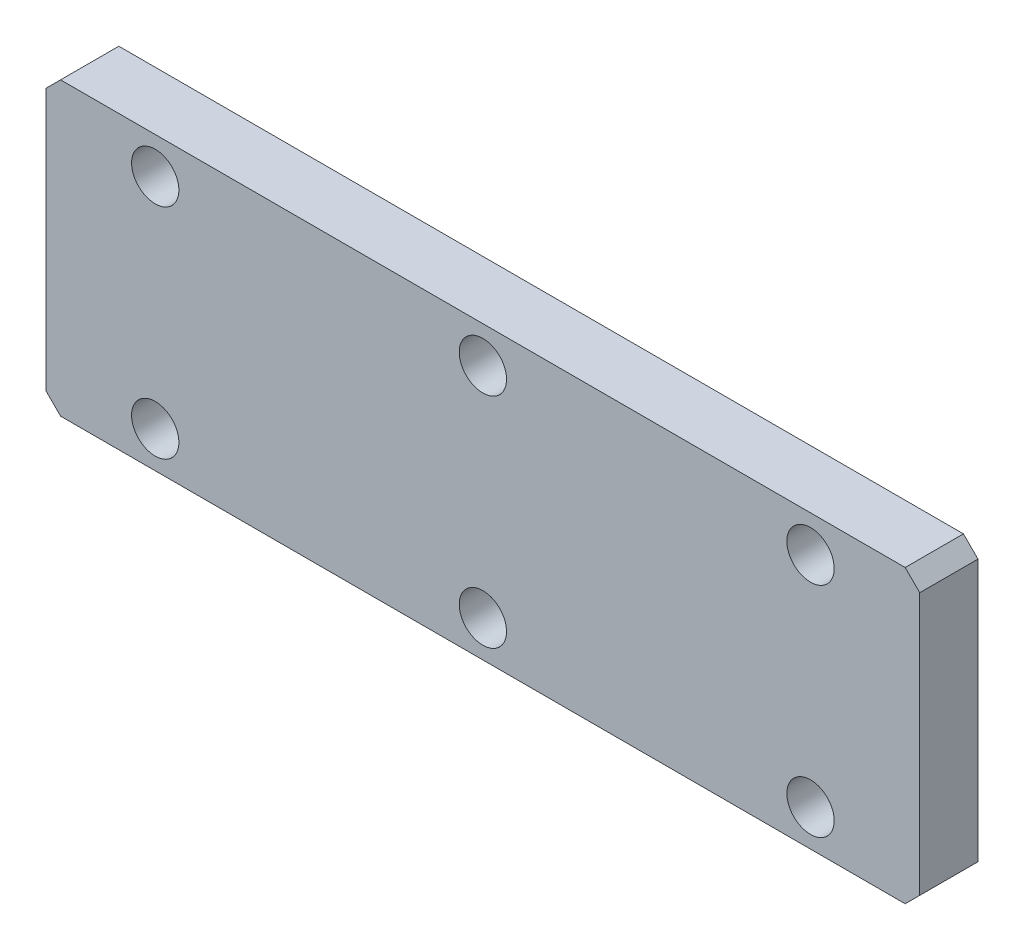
from build123d import *

# Parameters (mm, degrees)
ESQUISSE1_W      = 120
ESQUISSE1_H      = 40
ESQUISSE1_R      = 3.25
EXTRUSION1_DEPTH = 8
CHANFREIN1_SIZE  = 2


with BuildPart() as part:
    # Esquisse1 → Extrusion1 (new body)
    with BuildSketch(Plane.XY):
        with Locations((60, 20)):
            Rectangle(ESQUISSE1_W, ESQUISSE1_H)
        with Locations((105, 5)):
            Circle(ESQUISSE1_R, mode=Mode.SUBTRACT)
        with Locations((60, 5)):
            Circle(ESQUISSE1_R, mode=Mode.SUBTRACT)
        with Locations((15, 5)):
            Circle(ESQUISSE1_R, mode=Mode.SUBTRACT)
        with Locations((105, 35)):
            Circle(ESQUISSE1_R, mode=Mode.SUBTRACT)
        with Locations((60, 35)):
            Circle(ESQUISSE1_R, mode=Mode.SUBTRACT)
        with Locations((15, 35)):
            Circle(ESQUISSE1_R, mode=Mode.SUBTRACT)
    extrude(amount=EXTRUSION1_DEPTH)

    # Chanfrein1
    chanfrein1_edges = [part.edges().sort_by_distance(p)[0] for p in [
        (0, 40, 4),
        (120, 40, 4),
        (120, 0, 4),
        (0, 0, 4),
    ]]
    chamfer(chanfrein1_edges, length=CHANFREIN1_SIZE)


solid = part.part
